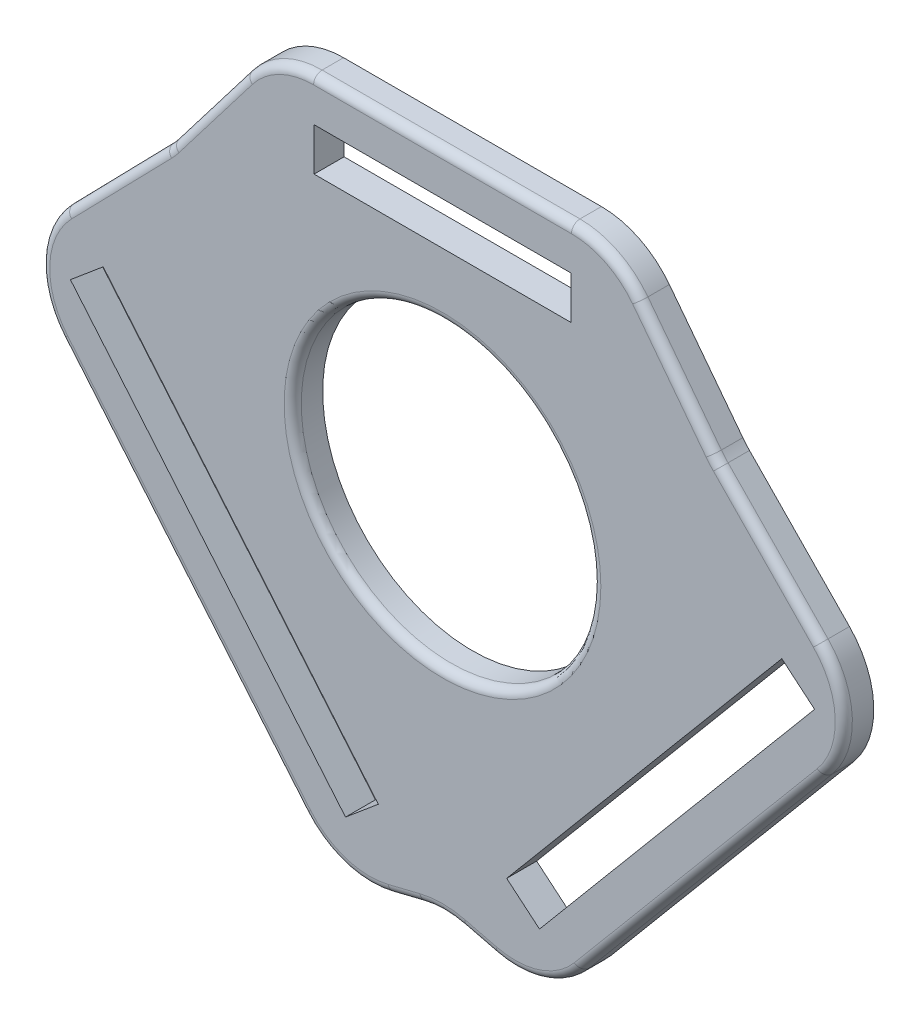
from build123d import *

# Parameters (mm, degrees)
AUFSATZ_LINEAR_AUSTRAGEN1_DEPTH = 3.5
SKIZZE1_3_W                     = 30
SKIZZE1_3_H                     = 5
SKIZZE1_3_R                     = 17.5
SCHNITT_LINEAR_AUSTRAGEN1_DEPTH = 8.5
VERRUNDUNG2_R                   = 1


with BuildPart() as part:
    # Skizze1 → Aufsatz-Linear austragen1 (new body)
    with BuildSketch(Plane.XY):
        with BuildLine():
            Line((-2.394714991, -7.590651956), (-6.113226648, -8.507815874))
            ThreePointArc((-6.113226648, -8.507815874), (-11.6101144, -8.305438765), (-16.16838607, -5.226658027))
            Line((-16.16838607, -5.226658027), (-44.544673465, 28.59088442))
            ThreePointArc((-44.544673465, 28.59088442), (-46.87724317, 35.392482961), (-44.043162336, 42.000857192))
            Line((-44.043162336, 42.000857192), (-32.362671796, 53.977181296))
            ThreePointArc((-32.362671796, 53.977181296), (-31.959362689, 54.416152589), (-31.582926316, 54.878375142))
            Line((-31.582926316, 54.878375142), (-23.001966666, 66.080902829))
            ThreePointArc((-23.001966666, 66.080902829), (-19.48996676, 68.966856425), (-15.063287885, 70))
            Line((-15.063287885, 70), (15.063287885, 70))
            ThreePointArc((15.063287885, 70), (19.48996676, 68.966856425), (23.001966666, 66.080902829))
            Line((23.001966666, 66.080902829), (31.582926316, 54.878375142))
            ThreePointArc((31.582926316, 54.878375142), (31.959362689, 54.416152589), (32.362671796, 53.977181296))
            Line((32.362671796, 53.977181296), (44.043162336, 42.000857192))
            ThreePointArc((44.043162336, 42.000857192), (46.87724317, 35.392482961), (44.544673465, 28.59088442))
            Line((44.544673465, 28.59088442), (16.16838607, -5.226658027))
            ThreePointArc((16.16838607, -5.226658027), (11.6101144, -8.305438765), (6.113226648, -8.507815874))
            Line((6.113226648, -8.507815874), (2.394714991, -7.590651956))
            ThreePointArc((2.394714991, -7.590651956), (0, -7.299685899), (-2.394714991, -7.590651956))
        make_face()
    extrude(amount=AUFSATZ_LINEAR_AUSTRAGEN1_DEPTH)

    # Skizze1_3 → Schnitt-Linear austragen1 (cut)
    with BuildSketch(Plane.XY):
        Polygon((-39.639380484, 38.302222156), (-43.4696027, 35.088284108), (-11.330222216, -3.213938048), (-7.5, 0), align=None)
        with Locations((0, 62.5)):
            Rectangle(SKIZZE1_3_W, SKIZZE1_3_H)
        Polygon((7.5, 0), (11.330222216, -3.213938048), (43.4696027, 35.088284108), (39.639380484, 38.302222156), align=None)
        with Locations((0, 35.018760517)):
            Circle(SKIZZE1_3_R)
    extrude(amount=SCHNITT_LINEAR_AUSTRAGEN1_DEPTH, mode=Mode.SUBTRACT)

    # Verrundung2
    verrundung2_edges = [part.edges().sort_by_distance(p)[0] for p in [
        (-11.6101144, -8.305438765, 3.5),
        (-4.25397082, -8.049233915, 3.5),
        (0, -7.299685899, 3.5),
        (4.25397082, -8.049233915, 3.5),
        (11.6101144, -8.305438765, 3.5),
        (30.356529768, 11.682113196, 3.5),
        (46.87724317, 35.392482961, 3.5),
        (38.202917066, 47.989019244, 3.5),
        (31.959362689, 54.416152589, 3.5),
        (27.292446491, 60.479638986, 3.5),
        (-46.87724317, 35.392482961, 3.5),
        (19.48996676, 68.966856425, 3.5),
        (0, 70, 3.5),
        (-19.48996676, 68.966856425, 3.5),
        (-27.292446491, 60.479638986, 3.5),
        (-31.959362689, 54.416152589, 3.5),
        (-38.202917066, 47.989019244, 3.5),
        (-30.356529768, 11.682113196, 3.5),
        (-17.5, 35.018760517, 3.5),
    ]]
    fillet(verrundung2_edges, radius=VERRUNDUNG2_R)


solid = part.part
